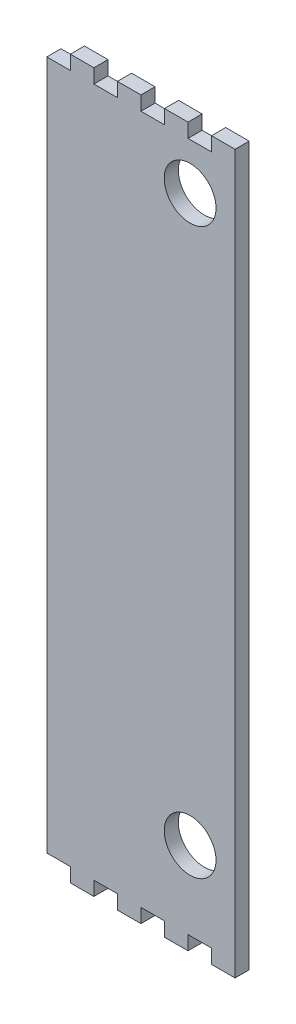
from build123d import *

# Parameters (mm, degrees)
ESTRUSIONE_ESTRUSIONE1_DEPTH = 6
SCHIZZO2_R                   = 11.000939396
TAGLIO_ESTRUSIONE1_DEPTH     = 162.158307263


with BuildPart() as part:
    # Schizzo1 → Estrusione-Estrusione1 (new body)
    with BuildSketch(Plane.XY):
        Polygon((-40, 143), (-40, -150), (-30, -150), (-30, -156), (-20, -156), (-20, -150), (-10, -150), (-10, -156), (0, -156), (0, -150), (10, -150), (10, -156), (20, -156), (20, -150), (30, -150), (30, -156), (40, -156), (40, 149), (30, 149), (30, 143), (20, 143), (20, 149), (10, 149), (10, 143), (0, 143), (0, 149), (-10, 149), (-10, 143), (-20, 143), (-20, 149), (-30, 149), (-30, 143), align=None)
    extrude(amount=ESTRUSIONE_ESTRUSIONE1_DEPTH)

    # Schizzo2 → Taglio-Estrusione1 (cut, through all)
    with BuildSketch(Plane.XY.offset(6)):
        with Locations((20.893747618, -116.756305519)):
            Circle(SCHIZZO2_R)
        with Locations((20.893747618, 123.243694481)):
            Circle(SCHIZZO2_R)
    extrude(amount=-TAGLIO_ESTRUSIONE1_DEPTH, mode=Mode.SUBTRACT)


solid = part.part
